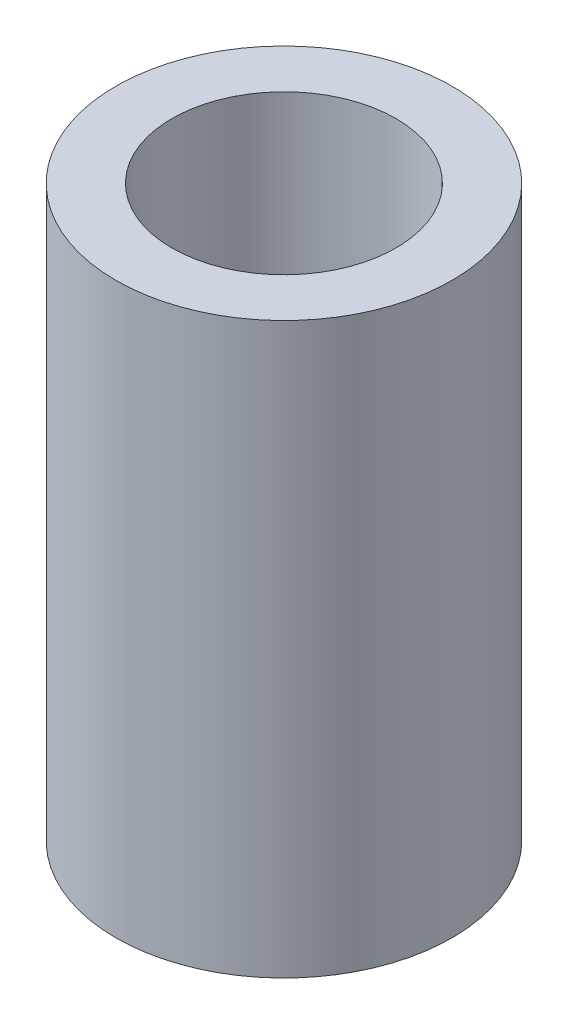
ISO-10303-21;
HEADER;
FILE_DESCRIPTION(('STEP AP214'),'2;1');
FILE_NAME('part.step','',(''),(''),'','','');
FILE_SCHEMA(('AUTOMOTIVE_DESIGN { 1 0 10303 214 1 1 1 1 }'));
ENDSEC;
DATA;
#1=APPLICATION_CONTEXT('core data for automotive mechanical design processes');
#2=APPLICATION_PROTOCOL_DEFINITION('international standard','automotive_design',2000,#1);
#3=PRODUCT_CONTEXT('',#1,'mechanical');
#4=PRODUCT('Part','Part','',(#3));
#5=PRODUCT_RELATED_PRODUCT_CATEGORY('part','',(#4));
#6=PRODUCT_DEFINITION_FORMATION('','',#4);
#7=PRODUCT_DEFINITION_CONTEXT('part definition',#1,'design');
#8=PRODUCT_DEFINITION('design','',#6,#7);
#9=PRODUCT_DEFINITION_SHAPE('','',#8);
#10=(LENGTH_UNIT() NAMED_UNIT(*) SI_UNIT(.MILLI.,.METRE.));
#11=(NAMED_UNIT(*) PLANE_ANGLE_UNIT() SI_UNIT($,.RADIAN.));
#12=(NAMED_UNIT(*) SI_UNIT($,.STERADIAN.) SOLID_ANGLE_UNIT());
#13=UNCERTAINTY_MEASURE_WITH_UNIT(LENGTH_MEASURE(1.E-05),#10,'distance_accuracy_value','');
#14=(GEOMETRIC_REPRESENTATION_CONTEXT(3) GLOBAL_UNCERTAINTY_ASSIGNED_CONTEXT((#13)) GLOBAL_UNIT_ASSIGNED_CONTEXT((#10,
#11,#12)) REPRESENTATION_CONTEXT('',''));
#15=CARTESIAN_POINT('',(0.,0.,0.));
#16=DIRECTION('',(0.,0.,1.));
#17=DIRECTION('',(1.,0.,0.));
#18=AXIS2_PLACEMENT_3D('',#15,#16,#17);
#19=CARTESIAN_POINT('',(0.,25.4,0.));
#20=DIRECTION('',(0.,1.,0.));
#21=DIRECTION('',(0.,0.,1.));
#22=AXIS2_PLACEMENT_3D('',#19,#20,#21);
#23=PLANE('',#22);
#24=CARTESIAN_POINT('',(0.,25.4,0.));
#25=DIRECTION('',(0.,1.,0.));
#26=DIRECTION('',(0.,0.,1.));
#27=AXIS2_PLACEMENT_3D('',#24,#25,#26);
#28=CIRCLE('',#27,7.5);
#29=CARTESIAN_POINT('',(0.,25.4,7.5));
#30=VERTEX_POINT('',#29);
#31=EDGE_CURVE('E10',#30,#30,#28,.T.);
#32=ORIENTED_EDGE('',*,*,#31,.T.);
#33=EDGE_LOOP('',(#32));
#34=FACE_BOUND('',#33,.T.);
#35=CARTESIAN_POINT('',(0.,25.4,0.));
#36=DIRECTION('',(0.,1.,0.));
#37=DIRECTION('',(0.,0.,1.));
#38=AXIS2_PLACEMENT_3D('',#35,#36,#37);
#39=CIRCLE('',#38,5.);
#40=CARTESIAN_POINT('',(0.,25.4,5.));
#41=VERTEX_POINT('',#40);
#42=EDGE_CURVE('E56',#41,#41,#39,.T.);
#43=ORIENTED_EDGE('',*,*,#42,.F.);
#44=EDGE_LOOP('',(#43));
#45=FACE_BOUND('',#44,.T.);
#46=ADVANCED_FACE('F43',(#34,#45),#23,.T.);
#47=CARTESIAN_POINT('',(0.,0.,0.));
#48=DIRECTION('',(0.,1.,0.));
#49=DIRECTION('',(0.,0.,1.));
#50=AXIS2_PLACEMENT_3D('',#47,#48,#49);
#51=PLANE('',#50);
#52=CARTESIAN_POINT('',(0.,0.,0.));
#53=DIRECTION('',(0.,1.,0.));
#54=DIRECTION('',(0.,0.,1.));
#55=AXIS2_PLACEMENT_3D('',#52,#53,#54);
#56=CIRCLE('',#55,7.5);
#57=CARTESIAN_POINT('',(0.,0.,7.5));
#58=VERTEX_POINT('',#57);
#59=EDGE_CURVE('E47',#58,#58,#56,.T.);
#60=ORIENTED_EDGE('',*,*,#59,.F.);
#61=EDGE_LOOP('',(#60));
#62=FACE_BOUND('',#61,.T.);
#63=CARTESIAN_POINT('',(0.,0.,0.));
#64=DIRECTION('',(0.,1.,0.));
#65=DIRECTION('',(0.,0.,1.));
#66=AXIS2_PLACEMENT_3D('',#63,#64,#65);
#67=CIRCLE('',#66,5.);
#68=CARTESIAN_POINT('',(0.,0.,5.));
#69=VERTEX_POINT('',#68);
#70=EDGE_CURVE('E58',#69,#69,#67,.T.);
#71=ORIENTED_EDGE('',*,*,#70,.T.);
#72=EDGE_LOOP('',(#71));
#73=FACE_BOUND('',#72,.T.);
#74=ADVANCED_FACE('F70',(#62,#73),#51,.F.);
#75=CARTESIAN_POINT('',(0.,25.4,0.));
#76=DIRECTION('',(0.,-1.,0.));
#77=DIRECTION('',(0.,0.,-1.));
#78=AXIS2_PLACEMENT_3D('',#75,#76,#77);
#79=CYLINDRICAL_SURFACE('',#78,7.5);
#80=ORIENTED_EDGE('',*,*,#31,.F.);
#81=EDGE_LOOP('',(#80));
#82=FACE_BOUND('',#81,.T.);
#83=ORIENTED_EDGE('',*,*,#59,.T.);
#84=EDGE_LOOP('',(#83));
#85=FACE_BOUND('',#84,.T.);
#86=ADVANCED_FACE('F45',(#82,#85),#79,.T.);
#87=CARTESIAN_POINT('',(0.,25.4,0.));
#88=DIRECTION('',(0.,-1.,0.));
#89=DIRECTION('',(0.,0.,-1.));
#90=AXIS2_PLACEMENT_3D('',#87,#88,#89);
#91=CYLINDRICAL_SURFACE('',#90,5.);
#92=ORIENTED_EDGE('',*,*,#42,.T.);
#93=EDGE_LOOP('',(#92));
#94=FACE_BOUND('',#93,.T.);
#95=ORIENTED_EDGE('',*,*,#70,.F.);
#96=EDGE_LOOP('',(#95));
#97=FACE_BOUND('',#96,.T.);
#98=ADVANCED_FACE('F66',(#94,#97),#91,.F.);
#99=CLOSED_SHELL('',(#46,#74,#86,#98));
#100=MANIFOLD_SOLID_BREP('B2',#99);
#101=ADVANCED_BREP_SHAPE_REPRESENTATION('',(#18,#100),#14);
#102=SHAPE_DEFINITION_REPRESENTATION(#9,#101);
ENDSEC;
END-ISO-10303-21;
